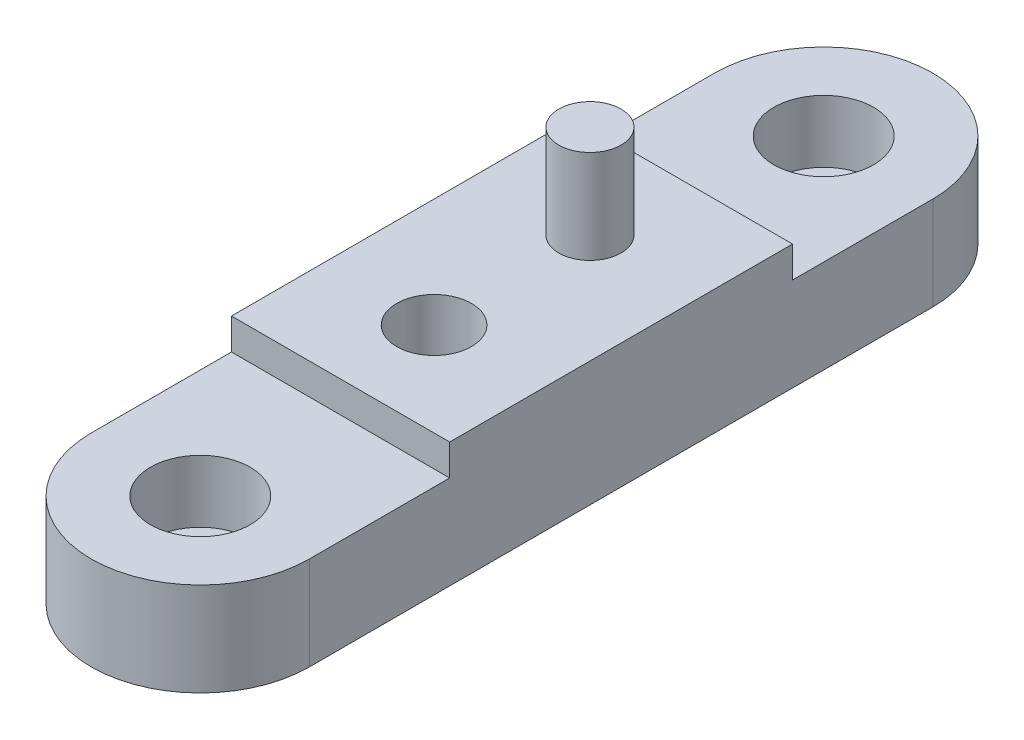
ISO-10303-21;
HEADER;
FILE_DESCRIPTION(('STEP AP214'),'2;1');
FILE_NAME('part.step','',(''),(''),'','','');
FILE_SCHEMA(('AUTOMOTIVE_DESIGN { 1 0 10303 214 1 1 1 1 }'));
ENDSEC;
DATA;
#1=APPLICATION_CONTEXT('core data for automotive mechanical design processes');
#2=APPLICATION_PROTOCOL_DEFINITION('international standard','automotive_design',2000,#1);
#3=PRODUCT_CONTEXT('',#1,'mechanical');
#4=PRODUCT('Part','Part','',(#3));
#5=PRODUCT_RELATED_PRODUCT_CATEGORY('part','',(#4));
#6=PRODUCT_DEFINITION_FORMATION('','',#4);
#7=PRODUCT_DEFINITION_CONTEXT('part definition',#1,'design');
#8=PRODUCT_DEFINITION('design','',#6,#7);
#9=PRODUCT_DEFINITION_SHAPE('','',#8);
#10=(LENGTH_UNIT() NAMED_UNIT(*) SI_UNIT(.MILLI.,.METRE.));
#11=(NAMED_UNIT(*) PLANE_ANGLE_UNIT() SI_UNIT($,.RADIAN.));
#12=(NAMED_UNIT(*) SI_UNIT($,.STERADIAN.) SOLID_ANGLE_UNIT());
#13=UNCERTAINTY_MEASURE_WITH_UNIT(LENGTH_MEASURE(1.E-05),#10,'distance_accuracy_value','');
#14=(GEOMETRIC_REPRESENTATION_CONTEXT(3) GLOBAL_UNCERTAINTY_ASSIGNED_CONTEXT((#13)) GLOBAL_UNIT_ASSIGNED_CONTEXT((#10,
#11,#12)) REPRESENTATION_CONTEXT('',''));
#15=CARTESIAN_POINT('',(0.,0.,0.));
#16=DIRECTION('',(0.,0.,1.));
#17=DIRECTION('',(1.,0.,0.));
#18=AXIS2_PLACEMENT_3D('',#15,#16,#17);
#19=CARTESIAN_POINT('',(0.,4.,0.));
#20=DIRECTION('',(0.,-1.,0.));
#21=DIRECTION('',(0.,0.,-1.));
#22=AXIS2_PLACEMENT_3D('',#19,#20,#21);
#23=CYLINDRICAL_SURFACE('',#22,3.5);
#24=CARTESIAN_POINT('',(0.,3.,0.));
#25=DIRECTION('',(0.,1.,0.));
#26=DIRECTION('',(0.,0.,1.));
#27=AXIS2_PLACEMENT_3D('',#24,#25,#26);
#28=CIRCLE('',#27,3.5);
#29=CARTESIAN_POINT('',(3.5,3.,0.));
#30=VERTEX_POINT('',#29);
#31=CARTESIAN_POINT('',(-3.5,3.,0.));
#32=VERTEX_POINT('',#31);
#33=EDGE_CURVE('E159',#30,#32,#28,.T.);
#34=ORIENTED_EDGE('',*,*,#33,.F.);
#35=DIRECTION('',(0.,-1.,0.));
#36=VECTOR('',#35,1.);
#37=CARTESIAN_POINT('',(3.5,4.,0.));
#38=LINE('',#37,#36);
#39=CARTESIAN_POINT('',(3.5,0.,0.));
#40=VERTEX_POINT('',#39);
#41=EDGE_CURVE('E44',#30,#40,#38,.T.);
#42=ORIENTED_EDGE('',*,*,#41,.T.);
#43=CARTESIAN_POINT('',(0.,0.,0.));
#44=DIRECTION('',(0.,1.,0.));
#45=DIRECTION('',(0.,0.,1.));
#46=AXIS2_PLACEMENT_3D('',#43,#44,#45);
#47=CIRCLE('',#46,3.5);
#48=CARTESIAN_POINT('',(-3.5,0.,0.));
#49=VERTEX_POINT('',#48);
#50=EDGE_CURVE('E165',#40,#49,#47,.T.);
#51=ORIENTED_EDGE('',*,*,#50,.T.);
#52=DIRECTION('',(0.,-1.,0.));
#53=VECTOR('',#52,1.);
#54=CARTESIAN_POINT('',(-3.5,4.,0.));
#55=LINE('',#54,#53);
#56=EDGE_CURVE('E11',#32,#49,#55,.T.);
#57=ORIENTED_EDGE('',*,*,#56,.F.);
#58=EDGE_LOOP('',(#34,#42,#51,#57));
#59=FACE_BOUND('',#58,.T.);
#60=ADVANCED_FACE('F37',(#59),#23,.T.);
#61=CARTESIAN_POINT('',(-3.5,4.,0.));
#62=DIRECTION('',(1.,0.,0.));
#63=DIRECTION('',(0.,0.,-1.));
#64=AXIS2_PLACEMENT_3D('',#61,#62,#63);
#65=PLANE('',#64);
#66=DIRECTION('',(0.,0.,1.));
#67=VECTOR('',#66,1.);
#68=CARTESIAN_POINT('',(-3.5,4.,0.));
#69=LINE('',#68,#67);
#70=CARTESIAN_POINT('',(-3.5,4.,4.5));
#71=VERTEX_POINT('',#70);
#72=CARTESIAN_POINT('',(-3.5,4.,15.5));
#73=VERTEX_POINT('',#72);
#74=EDGE_CURVE('E167',#71,#73,#69,.T.);
#75=ORIENTED_EDGE('',*,*,#74,.F.);
#76=DIRECTION('',(0.,1.,0.));
#77=VECTOR('',#76,1.);
#78=CARTESIAN_POINT('',(-3.5,3.,4.5));
#79=LINE('',#78,#77);
#80=CARTESIAN_POINT('',(-3.5,3.,4.5));
#81=VERTEX_POINT('',#80);
#82=EDGE_CURVE('E51',#81,#71,#79,.T.);
#83=ORIENTED_EDGE('',*,*,#82,.F.);
#84=DIRECTION('',(0.,0.,1.));
#85=VECTOR('',#84,1.);
#86=CARTESIAN_POINT('',(-3.5,3.,0.));
#87=LINE('',#86,#85);
#88=EDGE_CURVE('E151',#32,#81,#87,.T.);
#89=ORIENTED_EDGE('',*,*,#88,.F.);
#90=ORIENTED_EDGE('',*,*,#56,.T.);
#91=DIRECTION('',(0.,0.,1.));
#92=VECTOR('',#91,1.);
#93=CARTESIAN_POINT('',(-3.5,0.,0.));
#94=LINE('',#93,#92);
#95=CARTESIAN_POINT('',(-3.5,0.,20.));
#96=VERTEX_POINT('',#95);
#97=EDGE_CURVE('E174',#49,#96,#94,.T.);
#98=ORIENTED_EDGE('',*,*,#97,.T.);
#99=DIRECTION('',(0.,-1.,0.));
#100=VECTOR('',#99,1.);
#101=CARTESIAN_POINT('',(-3.5,4.,20.));
#102=LINE('',#101,#100);
#103=CARTESIAN_POINT('',(-3.5,3.,20.));
#104=VERTEX_POINT('',#103);
#105=EDGE_CURVE('E125',#104,#96,#102,.T.);
#106=ORIENTED_EDGE('',*,*,#105,.F.);
#107=DIRECTION('',(0.,0.,-1.));
#108=VECTOR('',#107,1.);
#109=CARTESIAN_POINT('',(-3.5,3.,20.));
#110=LINE('',#109,#108);
#111=CARTESIAN_POINT('',(-3.5,3.,15.5));
#112=VERTEX_POINT('',#111);
#113=EDGE_CURVE('E105',#104,#112,#110,.T.);
#114=ORIENTED_EDGE('',*,*,#113,.T.);
#115=DIRECTION('',(0.,1.,0.));
#116=VECTOR('',#115,1.);
#117=CARTESIAN_POINT('',(-3.5,3.,15.5));
#118=LINE('',#117,#116);
#119=EDGE_CURVE('E114',#112,#73,#118,.T.);
#120=ORIENTED_EDGE('',*,*,#119,.T.);
#121=EDGE_LOOP('',(#75,#83,#89,#90,#98,#106,#114,#120));
#122=FACE_BOUND('',#121,.T.);
#123=ADVANCED_FACE('F123',(#122),#65,.F.);
#124=CARTESIAN_POINT('',(3.5,4.,0.));
#125=DIRECTION('',(-1.,0.,0.));
#126=DIRECTION('',(0.,0.,1.));
#127=AXIS2_PLACEMENT_3D('',#124,#125,#126);
#128=PLANE('',#127);
#129=DIRECTION('',(0.,0.,-1.));
#130=VECTOR('',#129,1.);
#131=CARTESIAN_POINT('',(3.5,3.,0.));
#132=LINE('',#131,#130);
#133=CARTESIAN_POINT('',(3.5,3.,4.5));
#134=VERTEX_POINT('',#133);
#135=EDGE_CURVE('E157',#134,#30,#132,.T.);
#136=ORIENTED_EDGE('',*,*,#135,.F.);
#137=DIRECTION('',(0.,1.,0.));
#138=VECTOR('',#137,1.);
#139=CARTESIAN_POINT('',(3.5,3.,4.5));
#140=LINE('',#139,#138);
#141=CARTESIAN_POINT('',(3.5,4.,4.5));
#142=VERTEX_POINT('',#141);
#143=EDGE_CURVE('E162',#134,#142,#140,.T.);
#144=ORIENTED_EDGE('',*,*,#143,.T.);
#145=DIRECTION('',(0.,0.,-1.));
#146=VECTOR('',#145,1.);
#147=CARTESIAN_POINT('',(3.5,4.,0.));
#148=LINE('',#147,#146);
#149=CARTESIAN_POINT('',(3.5,4.,15.5));
#150=VERTEX_POINT('',#149);
#151=EDGE_CURVE('E169',#150,#142,#148,.T.);
#152=ORIENTED_EDGE('',*,*,#151,.F.);
#153=DIRECTION('',(0.,1.,0.));
#154=VECTOR('',#153,1.);
#155=CARTESIAN_POINT('',(3.5,3.,15.5));
#156=LINE('',#155,#154);
#157=CARTESIAN_POINT('',(3.5,3.,15.5));
#158=VERTEX_POINT('',#157);
#159=EDGE_CURVE('E120',#158,#150,#156,.T.);
#160=ORIENTED_EDGE('',*,*,#159,.F.);
#161=DIRECTION('',(0.,0.,1.));
#162=VECTOR('',#161,1.);
#163=CARTESIAN_POINT('',(3.5,3.,20.));
#164=LINE('',#163,#162);
#165=CARTESIAN_POINT('',(3.5,3.,20.));
#166=VERTEX_POINT('',#165);
#167=EDGE_CURVE('E107',#158,#166,#164,.T.);
#168=ORIENTED_EDGE('',*,*,#167,.T.);
#169=DIRECTION('',(0.,-1.,0.));
#170=VECTOR('',#169,1.);
#171=CARTESIAN_POINT('',(3.5,4.,20.));
#172=LINE('',#171,#170);
#173=CARTESIAN_POINT('',(3.5,0.,20.));
#174=VERTEX_POINT('',#173);
#175=EDGE_CURVE('E140',#166,#174,#172,.T.);
#176=ORIENTED_EDGE('',*,*,#175,.T.);
#177=DIRECTION('',(0.,0.,-1.));
#178=VECTOR('',#177,1.);
#179=CARTESIAN_POINT('',(3.5,0.,0.));
#180=LINE('',#179,#178);
#181=EDGE_CURVE('E170',#174,#40,#180,.T.);
#182=ORIENTED_EDGE('',*,*,#181,.T.);
#183=ORIENTED_EDGE('',*,*,#41,.F.);
#184=EDGE_LOOP('',(#136,#144,#152,#160,#168,#176,#182,#183));
#185=FACE_BOUND('',#184,.T.);
#186=ADVANCED_FACE('F179',(#185),#128,.F.);
#187=CARTESIAN_POINT('',(0.,4.,0.));
#188=DIRECTION('',(0.,1.,0.));
#189=DIRECTION('',(0.,0.,1.));
#190=AXIS2_PLACEMENT_3D('',#187,#188,#189);
#191=PLANE('',#190);
#192=CARTESIAN_POINT('',(0.,4.,12.5));
#193=DIRECTION('',(0.,1.,0.));
#194=DIRECTION('',(0.,0.,1.));
#195=AXIS2_PLACEMENT_3D('',#192,#193,#194);
#196=CIRCLE('',#195,1.2);
#197=CARTESIAN_POINT('',(0.,4.,13.7));
#198=VERTEX_POINT('',#197);
#199=EDGE_CURVE('E350',#198,#198,#196,.T.);
#200=ORIENTED_EDGE('',*,*,#199,.F.);
#201=EDGE_LOOP('',(#200));
#202=FACE_BOUND('',#201,.T.);
#203=CARTESIAN_POINT('',(0.,4.,7.5));
#204=DIRECTION('',(0.,1.,0.));
#205=DIRECTION('',(0.,0.,1.));
#206=AXIS2_PLACEMENT_3D('',#203,#204,#205);
#207=CIRCLE('',#206,1.);
#208=CARTESIAN_POINT('',(0.,4.,8.5));
#209=VERTEX_POINT('',#208);
#210=EDGE_CURVE('E352',#209,#209,#207,.T.);
#211=ORIENTED_EDGE('',*,*,#210,.F.);
#212=EDGE_LOOP('',(#211));
#213=FACE_BOUND('',#212,.T.);
#214=DIRECTION('',(1.,0.,0.));
#215=VECTOR('',#214,1.);
#216=CARTESIAN_POINT('',(-3.5,4.,4.5));
#217=LINE('',#216,#215);
#218=EDGE_CURVE('E148',#71,#142,#217,.T.);
#219=ORIENTED_EDGE('',*,*,#218,.F.);
#220=ORIENTED_EDGE('',*,*,#74,.T.);
#221=DIRECTION('',(1.,0.,0.));
#222=VECTOR('',#221,1.);
#223=CARTESIAN_POINT('',(-3.5,4.,15.5));
#224=LINE('',#223,#222);
#225=EDGE_CURVE('E117',#73,#150,#224,.T.);
#226=ORIENTED_EDGE('',*,*,#225,.T.);
#227=ORIENTED_EDGE('',*,*,#151,.T.);
#228=EDGE_LOOP('',(#219,#220,#226,#227));
#229=FACE_BOUND('',#228,.T.);
#230=ADVANCED_FACE('F190',(#202,#213,#229),#191,.T.);
#231=CARTESIAN_POINT('',(0.,0.,0.));
#232=DIRECTION('',(0.,1.,0.));
#233=DIRECTION('',(0.,0.,1.));
#234=AXIS2_PLACEMENT_3D('',#231,#232,#233);
#235=PLANE('',#234);
#236=CARTESIAN_POINT('',(0.,0.,12.5));
#237=DIRECTION('',(0.,1.,0.));
#238=DIRECTION('',(0.,0.,1.));
#239=AXIS2_PLACEMENT_3D('',#236,#237,#238);
#240=CIRCLE('',#239,1.2);
#241=CARTESIAN_POINT('',(0.,0.,13.7));
#242=VERTEX_POINT('',#241);
#243=EDGE_CURVE('E347',#242,#242,#240,.T.);
#244=ORIENTED_EDGE('',*,*,#243,.T.);
#245=EDGE_LOOP('',(#244));
#246=FACE_BOUND('',#245,.T.);
#247=ORIENTED_EDGE('',*,*,#50,.F.);
#248=ORIENTED_EDGE('',*,*,#181,.F.);
#249=CARTESIAN_POINT('',(0.,0.,20.));
#250=DIRECTION('',(0.,-1.,0.));
#251=DIRECTION('',(0.,0.,-1.));
#252=AXIS2_PLACEMENT_3D('',#249,#250,#251);
#253=CIRCLE('',#252,3.5);
#254=EDGE_CURVE('E136',#174,#96,#253,.T.);
#255=ORIENTED_EDGE('',*,*,#254,.T.);
#256=ORIENTED_EDGE('',*,*,#97,.F.);
#257=EDGE_LOOP('',(#247,#248,#255,#256));
#258=FACE_BOUND('',#257,.T.);
#259=ADVANCED_FACE('F184',(#246,#258),#235,.F.);
#260=CARTESIAN_POINT('',(-3.5,3.,4.5));
#261=DIRECTION('',(0.,0.,1.));
#262=DIRECTION('',(1.,0.,0.));
#263=AXIS2_PLACEMENT_3D('',#260,#261,#262);
#264=PLANE('',#263);
#265=ORIENTED_EDGE('',*,*,#218,.T.);
#266=ORIENTED_EDGE('',*,*,#143,.F.);
#267=DIRECTION('',(1.,0.,0.));
#268=VECTOR('',#267,1.);
#269=CARTESIAN_POINT('',(-3.5,3.,4.5));
#270=LINE('',#269,#268);
#271=EDGE_CURVE('E154',#81,#134,#270,.T.);
#272=ORIENTED_EDGE('',*,*,#271,.F.);
#273=ORIENTED_EDGE('',*,*,#82,.T.);
#274=EDGE_LOOP('',(#265,#266,#272,#273));
#275=FACE_BOUND('',#274,.T.);
#276=ADVANCED_FACE('F215',(#275),#264,.F.);
#277=CARTESIAN_POINT('',(0.,3.,0.));
#278=DIRECTION('',(0.,1.,0.));
#279=DIRECTION('',(0.,0.,1.));
#280=AXIS2_PLACEMENT_3D('',#277,#278,#279);
#281=PLANE('',#280);
#282=CARTESIAN_POINT('',(0.,3.,0.));
#283=DIRECTION('',(0.,1.,0.));
#284=DIRECTION('',(0.,0.,1.));
#285=AXIS2_PLACEMENT_3D('',#282,#283,#284);
#286=CIRCLE('',#285,1.6);
#287=CARTESIAN_POINT('',(0.,3.,1.6));
#288=VERTEX_POINT('',#287);
#289=EDGE_CURVE('E144',#288,#288,#286,.T.);
#290=ORIENTED_EDGE('',*,*,#289,.F.);
#291=EDGE_LOOP('',(#290));
#292=FACE_BOUND('',#291,.T.);
#293=ORIENTED_EDGE('',*,*,#88,.T.);
#294=ORIENTED_EDGE('',*,*,#271,.T.);
#295=ORIENTED_EDGE('',*,*,#135,.T.);
#296=ORIENTED_EDGE('',*,*,#33,.T.);
#297=EDGE_LOOP('',(#293,#294,#295,#296));
#298=FACE_BOUND('',#297,.T.);
#299=ADVANCED_FACE('F188',(#292,#298),#281,.T.);
#300=CARTESIAN_POINT('',(0.,1.,0.));
#301=DIRECTION('',(0.,1.,0.));
#302=DIRECTION('',(0.,0.,1.));
#303=AXIS2_PLACEMENT_3D('',#300,#301,#302);
#304=CYLINDRICAL_SURFACE('',#303,1.6);
#305=CARTESIAN_POINT('',(0.,1.,0.));
#306=DIRECTION('',(0.,1.,0.));
#307=DIRECTION('',(0.,0.,1.));
#308=AXIS2_PLACEMENT_3D('',#305,#306,#307);
#309=CIRCLE('',#308,1.6);
#310=CARTESIAN_POINT('',(0.,1.,1.6));
#311=VERTEX_POINT('',#310);
#312=EDGE_CURVE('E145',#311,#311,#309,.T.);
#313=ORIENTED_EDGE('',*,*,#312,.F.);
#314=EDGE_LOOP('',(#313));
#315=FACE_BOUND('',#314,.T.);
#316=ORIENTED_EDGE('',*,*,#289,.T.);
#317=EDGE_LOOP('',(#316));
#318=FACE_BOUND('',#317,.T.);
#319=ADVANCED_FACE('F201',(#315,#318),#304,.F.);
#320=CARTESIAN_POINT('',(0.,1.,0.));
#321=DIRECTION('',(0.,1.,0.));
#322=DIRECTION('',(0.,0.,1.));
#323=AXIS2_PLACEMENT_3D('',#320,#321,#322);
#324=PLANE('',#323);
#325=ORIENTED_EDGE('',*,*,#312,.T.);
#326=EDGE_LOOP('',(#325));
#327=FACE_BOUND('',#326,.T.);
#328=ADVANCED_FACE('F194',(#327),#324,.T.);
#329=CARTESIAN_POINT('',(0.,4.,20.));
#330=DIRECTION('',(0.,-1.,0.));
#331=DIRECTION('',(0.,0.,1.));
#332=AXIS2_PLACEMENT_3D('',#329,#330,#331);
#333=CYLINDRICAL_SURFACE('',#332,3.5);
#334=CARTESIAN_POINT('',(0.,3.,20.));
#335=DIRECTION('',(0.,-1.,0.));
#336=DIRECTION('',(0.,0.,-1.));
#337=AXIS2_PLACEMENT_3D('',#334,#335,#336);
#338=CIRCLE('',#337,3.5);
#339=EDGE_CURVE('E121',#166,#104,#338,.T.);
#340=ORIENTED_EDGE('',*,*,#339,.T.);
#341=ORIENTED_EDGE('',*,*,#105,.T.);
#342=ORIENTED_EDGE('',*,*,#254,.F.);
#343=ORIENTED_EDGE('',*,*,#175,.F.);
#344=EDGE_LOOP('',(#340,#341,#342,#343));
#345=FACE_BOUND('',#344,.T.);
#346=ADVANCED_FACE('F192',(#345),#333,.T.);
#347=CARTESIAN_POINT('',(-3.5,3.,15.5));
#348=DIRECTION('',(0.,0.,-1.));
#349=DIRECTION('',(1.,0.,0.));
#350=AXIS2_PLACEMENT_3D('',#347,#348,#349);
#351=PLANE('',#350);
#352=ORIENTED_EDGE('',*,*,#225,.F.);
#353=ORIENTED_EDGE('',*,*,#119,.F.);
#354=DIRECTION('',(1.,0.,0.));
#355=VECTOR('',#354,1.);
#356=CARTESIAN_POINT('',(-3.5,3.,15.5));
#357=LINE('',#356,#355);
#358=EDGE_CURVE('E100',#112,#158,#357,.T.);
#359=ORIENTED_EDGE('',*,*,#358,.T.);
#360=ORIENTED_EDGE('',*,*,#159,.T.);
#361=EDGE_LOOP('',(#352,#353,#359,#360));
#362=FACE_BOUND('',#361,.T.);
#363=ADVANCED_FACE('F115',(#362),#351,.F.);
#364=CARTESIAN_POINT('',(0.,3.,20.));
#365=DIRECTION('',(0.,1.,0.));
#366=DIRECTION('',(0.,0.,-1.));
#367=AXIS2_PLACEMENT_3D('',#364,#365,#366);
#368=PLANE('',#367);
#369=CARTESIAN_POINT('',(0.,3.,20.));
#370=DIRECTION('',(0.,-1.,0.));
#371=DIRECTION('',(0.,0.,-1.));
#372=AXIS2_PLACEMENT_3D('',#369,#370,#371);
#373=CIRCLE('',#372,1.6);
#374=CARTESIAN_POINT('',(0.,3.,18.4));
#375=VERTEX_POINT('',#374);
#376=EDGE_CURVE('E131',#375,#375,#373,.T.);
#377=ORIENTED_EDGE('',*,*,#376,.T.);
#378=EDGE_LOOP('',(#377));
#379=FACE_BOUND('',#378,.T.);
#380=ORIENTED_EDGE('',*,*,#113,.F.);
#381=ORIENTED_EDGE('',*,*,#339,.F.);
#382=ORIENTED_EDGE('',*,*,#167,.F.);
#383=ORIENTED_EDGE('',*,*,#358,.F.);
#384=EDGE_LOOP('',(#380,#381,#382,#383));
#385=FACE_BOUND('',#384,.T.);
#386=ADVANCED_FACE('F102',(#379,#385),#368,.T.);
#387=CARTESIAN_POINT('',(0.,1.,20.));
#388=DIRECTION('',(0.,1.,0.));
#389=DIRECTION('',(0.,0.,-1.));
#390=AXIS2_PLACEMENT_3D('',#387,#388,#389);
#391=CYLINDRICAL_SURFACE('',#390,1.6);
#392=CARTESIAN_POINT('',(0.,1.,20.));
#393=DIRECTION('',(0.,-1.,0.));
#394=DIRECTION('',(0.,0.,-1.));
#395=AXIS2_PLACEMENT_3D('',#392,#393,#394);
#396=CIRCLE('',#395,1.6);
#397=CARTESIAN_POINT('',(0.,1.,18.4));
#398=VERTEX_POINT('',#397);
#399=EDGE_CURVE('E128',#398,#398,#396,.T.);
#400=ORIENTED_EDGE('',*,*,#399,.T.);
#401=EDGE_LOOP('',(#400));
#402=FACE_BOUND('',#401,.T.);
#403=ORIENTED_EDGE('',*,*,#376,.F.);
#404=EDGE_LOOP('',(#403));
#405=FACE_BOUND('',#404,.T.);
#406=ADVANCED_FACE('F292',(#402,#405),#391,.F.);
#407=CARTESIAN_POINT('',(0.,1.,20.));
#408=DIRECTION('',(0.,1.,0.));
#409=DIRECTION('',(0.,0.,-1.));
#410=AXIS2_PLACEMENT_3D('',#407,#408,#409);
#411=PLANE('',#410);
#412=ORIENTED_EDGE('',*,*,#399,.F.);
#413=EDGE_LOOP('',(#412));
#414=FACE_BOUND('',#413,.T.);
#415=ADVANCED_FACE('F301',(#414),#411,.T.);
#416=CARTESIAN_POINT('',(0.,7.,7.5));
#417=DIRECTION('',(0.,-1.,0.));
#418=DIRECTION('',(0.,0.,-1.));
#419=AXIS2_PLACEMENT_3D('',#416,#417,#418);
#420=CYLINDRICAL_SURFACE('',#419,1.);
#421=CARTESIAN_POINT('',(0.,7.,7.5));
#422=DIRECTION('',(0.,1.,0.));
#423=DIRECTION('',(0.,0.,1.));
#424=AXIS2_PLACEMENT_3D('',#421,#422,#423);
#425=CIRCLE('',#424,1.);
#426=CARTESIAN_POINT('',(0.,7.,8.5));
#427=VERTEX_POINT('',#426);
#428=EDGE_CURVE('E355',#427,#427,#425,.T.);
#429=ORIENTED_EDGE('',*,*,#428,.F.);
#430=EDGE_LOOP('',(#429));
#431=FACE_BOUND('',#430,.T.);
#432=ORIENTED_EDGE('',*,*,#210,.T.);
#433=EDGE_LOOP('',(#432));
#434=FACE_BOUND('',#433,.T.);
#435=ADVANCED_FACE('F310',(#431,#434),#420,.T.);
#436=CARTESIAN_POINT('',(0.,7.,7.5));
#437=DIRECTION('',(0.,1.,0.));
#438=DIRECTION('',(0.,0.,1.));
#439=AXIS2_PLACEMENT_3D('',#436,#437,#438);
#440=PLANE('',#439);
#441=ORIENTED_EDGE('',*,*,#428,.T.);
#442=EDGE_LOOP('',(#441));
#443=FACE_BOUND('',#442,.T.);
#444=ADVANCED_FACE('F319',(#443),#440,.T.);
#445=CARTESIAN_POINT('',(0.,0.,12.5));
#446=DIRECTION('',(0.,1.,0.));
#447=DIRECTION('',(0.,0.,1.));
#448=AXIS2_PLACEMENT_3D('',#445,#446,#447);
#449=CYLINDRICAL_SURFACE('',#448,1.2);
#450=ORIENTED_EDGE('',*,*,#243,.F.);
#451=EDGE_LOOP('',(#450));
#452=FACE_BOUND('',#451,.T.);
#453=ORIENTED_EDGE('',*,*,#199,.T.);
#454=EDGE_LOOP('',(#453));
#455=FACE_BOUND('',#454,.T.);
#456=ADVANCED_FACE('F327',(#452,#455),#449,.F.);
#457=CLOSED_SHELL('',(#60,#123,#186,#230,#259,#276,#299,#319,#328,#346,#363,#386,#406,#415,#435,
#444,#456));
#458=MANIFOLD_SOLID_BREP('B2',#457);
#459=ADVANCED_BREP_SHAPE_REPRESENTATION('',(#18,#458),#14);
#460=SHAPE_DEFINITION_REPRESENTATION(#9,#459);
ENDSEC;
END-ISO-10303-21;
